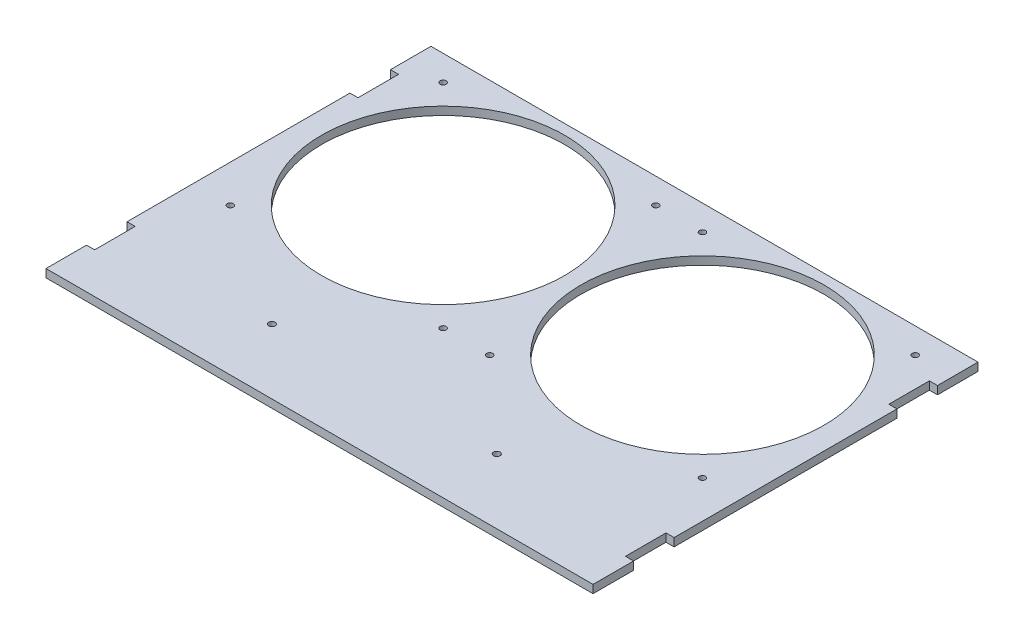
from build123d import *

# Parameters (mm, degrees)
SKIZZE1_R                       = 60
SKIZZE1_R_2                     = 1.5
SKIZZE1_R_3                     = 1.6
AUFSATZ_LINEAR_AUSTRAGEN1_DEPTH = 4


with BuildPart() as part:
    # Skizze1 → Aufsatz-Linear austragen1 (new body)
    with BuildSketch(Plane(origin=(0, 0, 0), x_dir=(1, 0, 0), z_dir=(0, 1, 0))):
        Polygon((-135, 65), (135, 65), (135, 45), (131, 45), (131, 25), (135, 25), (135, -85), (131, -85), (131, -105), (135, -105), (135, -125), (-135, -125), (-135, -105), (-131, -105), (-131, -85), (-135, -85), (-135, 25), (-131, 25), (-131, 45), (-135, 45), align=None)
        with Locations(Location((-64, 0, 0), (0, 0, 270))):
            Circle(SKIZZE1_R, mode=Mode.SUBTRACT)
        with Locations(Location((-116.5, 52.5, 0), (0, 0, 270))):
            Circle(SKIZZE1_R_2, mode=Mode.SUBTRACT)
        with Locations(Location((-11.5, 52.5, 0), (0, 0, 90))):
            Circle(SKIZZE1_R_2, mode=Mode.SUBTRACT)
        with Locations(Location((-116.5, -52.5, 0), (0, 0, 90))):
            Circle(SKIZZE1_R_2, mode=Mode.SUBTRACT)
        with Locations(Location((-11.5, -52.5, 0), (0, 0, 270))):
            Circle(SKIZZE1_R_2, mode=Mode.SUBTRACT)
        with Locations(Location((116.5, -52.5, 0), (0, 0, 270))):
            Circle(SKIZZE1_R_2, mode=Mode.SUBTRACT)
        with Locations(Location((11.5, -52.5, 0), (0, 0, 90))):
            Circle(SKIZZE1_R_2, mode=Mode.SUBTRACT)
        with Locations(Location((11.5, 52.5, 0), (0, 0, 270))):
            Circle(SKIZZE1_R_2, mode=Mode.SUBTRACT)
        with Locations(Location((116.5, 52.5, 0), (0, 0, 90))):
            Circle(SKIZZE1_R_2, mode=Mode.SUBTRACT)
        with Locations(Location((64, 0, 0), (0, 0, 90))):
            Circle(SKIZZE1_R, mode=Mode.SUBTRACT)
        with Locations(Location((-55.5, -93, 0), (0, 0, 270))):
            Circle(SKIZZE1_R_3, mode=Mode.SUBTRACT)
        with Locations(Location((55.5, -93, 0), (0, 0, 90))):
            Circle(SKIZZE1_R_3, mode=Mode.SUBTRACT)
    extrude(amount=AUFSATZ_LINEAR_AUSTRAGEN1_DEPTH)


solid = part.part
